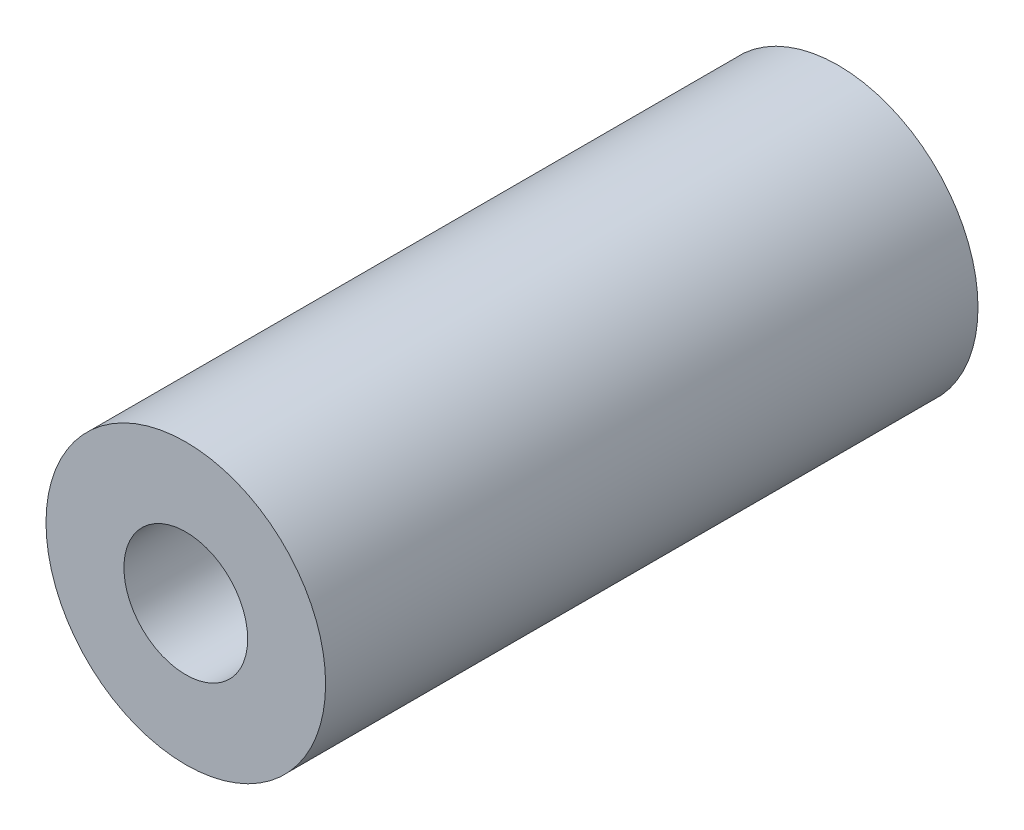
ISO-10303-21;
HEADER;
FILE_DESCRIPTION(('STEP AP214'),'2;1');
FILE_NAME('part.step','',(''),(''),'','','');
FILE_SCHEMA(('AUTOMOTIVE_DESIGN { 1 0 10303 214 1 1 1 1 }'));
ENDSEC;
DATA;
#1=APPLICATION_CONTEXT('core data for automotive mechanical design processes');
#2=APPLICATION_PROTOCOL_DEFINITION('international standard','automotive_design',2000,#1);
#3=PRODUCT_CONTEXT('',#1,'mechanical');
#4=PRODUCT('Part','Part','',(#3));
#5=PRODUCT_RELATED_PRODUCT_CATEGORY('part','',(#4));
#6=PRODUCT_DEFINITION_FORMATION('','',#4);
#7=PRODUCT_DEFINITION_CONTEXT('part definition',#1,'design');
#8=PRODUCT_DEFINITION('design','',#6,#7);
#9=PRODUCT_DEFINITION_SHAPE('','',#8);
#10=(LENGTH_UNIT() NAMED_UNIT(*) SI_UNIT(.MILLI.,.METRE.));
#11=(NAMED_UNIT(*) PLANE_ANGLE_UNIT() SI_UNIT($,.RADIAN.));
#12=(NAMED_UNIT(*) SI_UNIT($,.STERADIAN.) SOLID_ANGLE_UNIT());
#13=UNCERTAINTY_MEASURE_WITH_UNIT(LENGTH_MEASURE(1.E-05),#10,'distance_accuracy_value','');
#14=(GEOMETRIC_REPRESENTATION_CONTEXT(3) GLOBAL_UNCERTAINTY_ASSIGNED_CONTEXT((#13)) GLOBAL_UNIT_ASSIGNED_CONTEXT((#10,
#11,#12)) REPRESENTATION_CONTEXT('',''));
#15=CARTESIAN_POINT('',(0.,0.,0.));
#16=DIRECTION('',(0.,0.,1.));
#17=DIRECTION('',(1.,0.,0.));
#18=AXIS2_PLACEMENT_3D('',#15,#16,#17);
#19=CARTESIAN_POINT('',(0.,0.,11.1125));
#20=DIRECTION('',(0.,0.,1.));
#21=DIRECTION('',(1.,0.,0.));
#22=AXIS2_PLACEMENT_3D('',#19,#20,#21);
#23=PLANE('',#22);
#24=CARTESIAN_POINT('',(0.,0.,11.1125));
#25=DIRECTION('',(0.,0.,1.));
#26=DIRECTION('',(1.,0.,0.));
#27=AXIS2_PLACEMENT_3D('',#24,#25,#26);
#28=CIRCLE('',#27,4.7625);
#29=CARTESIAN_POINT('',(4.7625,0.,11.1125));
#30=VERTEX_POINT('',#29);
#31=EDGE_CURVE('E10',#30,#30,#28,.T.);
#32=ORIENTED_EDGE('',*,*,#31,.T.);
#33=EDGE_LOOP('',(#32));
#34=FACE_BOUND('',#33,.T.);
#35=CARTESIAN_POINT('',(0.,0.,11.1125));
#36=DIRECTION('',(0.,0.,1.));
#37=DIRECTION('',(1.,0.,0.));
#38=AXIS2_PLACEMENT_3D('',#35,#36,#37);
#39=CIRCLE('',#38,2.1082);
#40=CARTESIAN_POINT('',(2.1082,0.,11.1125));
#41=VERTEX_POINT('',#40);
#42=EDGE_CURVE('E37',#41,#41,#39,.T.);
#43=ORIENTED_EDGE('',*,*,#42,.F.);
#44=EDGE_LOOP('',(#43));
#45=FACE_BOUND('',#44,.T.);
#46=ADVANCED_FACE('F30',(#34,#45),#23,.T.);
#47=CARTESIAN_POINT('',(0.,0.,11.1125));
#48=DIRECTION('',(0.,0.,-1.));
#49=DIRECTION('',(-1.,0.,0.));
#50=AXIS2_PLACEMENT_3D('',#47,#48,#49);
#51=CYLINDRICAL_SURFACE('',#50,4.7625);
#52=ORIENTED_EDGE('',*,*,#31,.F.);
#53=EDGE_LOOP('',(#52));
#54=FACE_BOUND('',#53,.T.);
#55=CARTESIAN_POINT('',(0.,0.,-11.1125));
#56=DIRECTION('',(0.,0.,1.));
#57=DIRECTION('',(1.,0.,0.));
#58=AXIS2_PLACEMENT_3D('',#55,#56,#57);
#59=CIRCLE('',#58,4.7625);
#60=CARTESIAN_POINT('',(4.7625,0.,-11.1125));
#61=VERTEX_POINT('',#60);
#62=EDGE_CURVE('E41',#61,#61,#59,.T.);
#63=ORIENTED_EDGE('',*,*,#62,.T.);
#64=EDGE_LOOP('',(#63));
#65=FACE_BOUND('',#64,.T.);
#66=ADVANCED_FACE('F32',(#54,#65),#51,.T.);
#67=CARTESIAN_POINT('',(0.,0.,11.1125));
#68=DIRECTION('',(0.,0.,-1.));
#69=DIRECTION('',(-1.,0.,0.));
#70=AXIS2_PLACEMENT_3D('',#67,#68,#69);
#71=CYLINDRICAL_SURFACE('',#70,2.1082);
#72=ORIENTED_EDGE('',*,*,#42,.T.);
#73=EDGE_LOOP('',(#72));
#74=FACE_BOUND('',#73,.T.);
#75=CARTESIAN_POINT('',(0.,0.,-11.1125));
#76=DIRECTION('',(0.,0.,1.));
#77=DIRECTION('',(1.,0.,0.));
#78=AXIS2_PLACEMENT_3D('',#75,#76,#77);
#79=CIRCLE('',#78,2.1082);
#80=CARTESIAN_POINT('',(2.1082,0.,-11.1125));
#81=VERTEX_POINT('',#80);
#82=EDGE_CURVE('E45',#81,#81,#79,.T.);
#83=ORIENTED_EDGE('',*,*,#82,.F.);
#84=EDGE_LOOP('',(#83));
#85=FACE_BOUND('',#84,.T.);
#86=ADVANCED_FACE('F54',(#74,#85),#71,.F.);
#87=CARTESIAN_POINT('',(0.,0.,-11.1125));
#88=DIRECTION('',(0.,0.,1.));
#89=DIRECTION('',(1.,0.,0.));
#90=AXIS2_PLACEMENT_3D('',#87,#88,#89);
#91=PLANE('',#90);
#92=ORIENTED_EDGE('',*,*,#82,.T.);
#93=EDGE_LOOP('',(#92));
#94=FACE_BOUND('',#93,.T.);
#95=ORIENTED_EDGE('',*,*,#62,.F.);
#96=EDGE_LOOP('',(#95));
#97=FACE_BOUND('',#96,.T.);
#98=ADVANCED_FACE('F51',(#94,#97),#91,.F.);
#99=CLOSED_SHELL('',(#46,#66,#86,#98));
#100=MANIFOLD_SOLID_BREP('B2',#99);
#101=ADVANCED_BREP_SHAPE_REPRESENTATION('',(#18,#100),#14);
#102=SHAPE_DEFINITION_REPRESENTATION(#9,#101);
ENDSEC;
END-ISO-10303-21;
